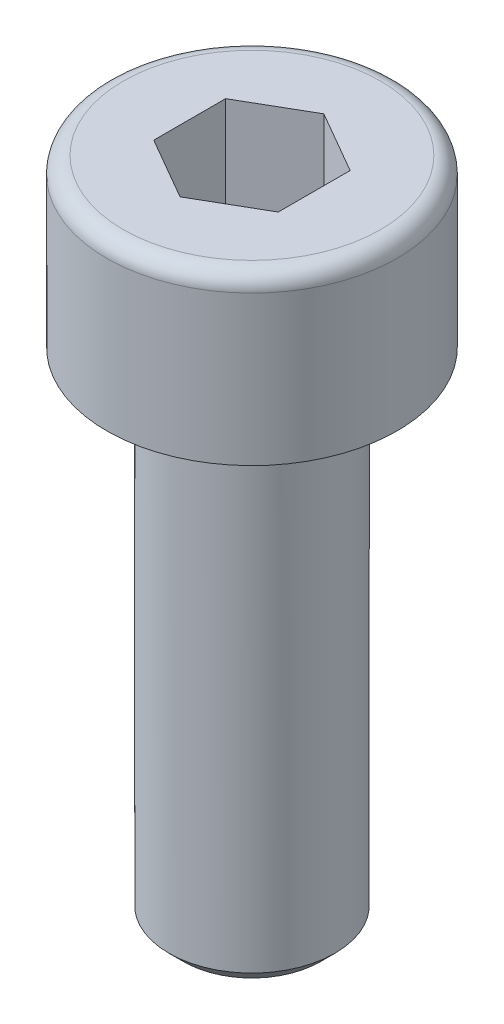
ISO-10303-21;
HEADER;
FILE_DESCRIPTION(('STEP AP214'),'2;1');
FILE_NAME('part.step','',(''),(''),'','','');
FILE_SCHEMA(('AUTOMOTIVE_DESIGN { 1 0 10303 214 1 1 1 1 }'));
ENDSEC;
DATA;
#1=APPLICATION_CONTEXT('core data for automotive mechanical design processes');
#2=APPLICATION_PROTOCOL_DEFINITION('international standard','automotive_design',2000,#1);
#3=PRODUCT_CONTEXT('',#1,'mechanical');
#4=PRODUCT('Part','Part','',(#3));
#5=PRODUCT_RELATED_PRODUCT_CATEGORY('part','',(#4));
#6=PRODUCT_DEFINITION_FORMATION('','',#4);
#7=PRODUCT_DEFINITION_CONTEXT('part definition',#1,'design');
#8=PRODUCT_DEFINITION('design','',#6,#7);
#9=PRODUCT_DEFINITION_SHAPE('','',#8);
#10=(LENGTH_UNIT() NAMED_UNIT(*) SI_UNIT(.MILLI.,.METRE.));
#11=(NAMED_UNIT(*) PLANE_ANGLE_UNIT() SI_UNIT($,.RADIAN.));
#12=(NAMED_UNIT(*) SI_UNIT($,.STERADIAN.) SOLID_ANGLE_UNIT());
#13=UNCERTAINTY_MEASURE_WITH_UNIT(LENGTH_MEASURE(1.E-05),#10,'distance_accuracy_value','');
#14=(GEOMETRIC_REPRESENTATION_CONTEXT(3) GLOBAL_UNCERTAINTY_ASSIGNED_CONTEXT((#13)) GLOBAL_UNIT_ASSIGNED_CONTEXT((#10,
#11,#12)) REPRESENTATION_CONTEXT('',''));
#15=CARTESIAN_POINT('',(0.,0.,0.));
#16=DIRECTION('',(0.,0.,1.));
#17=DIRECTION('',(1.,0.,0.));
#18=AXIS2_PLACEMENT_3D('',#15,#16,#17);
#19=CARTESIAN_POINT('',(1.99999999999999,-16.,0.));
#20=DIRECTION('',(0.,-1.,0.));
#21=DIRECTION('',(1.,0.,0.));
#22=AXIS2_PLACEMENT_3D('',#19,#20,#21);
#23=PLANE('',#22);
#24=CARTESIAN_POINT('',(0.,-16.,0.));
#25=DIRECTION('',(0.,-1.,0.));
#26=DIRECTION('',(1.,0.,0.));
#27=AXIS2_PLACEMENT_3D('',#24,#25,#26);
#28=CIRCLE('',#27,1.65);
#29=CARTESIAN_POINT('',(1.64999999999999,-16.,0.));
#30=VERTEX_POINT('',#29);
#31=EDGE_CURVE('E11',#30,#30,#28,.T.);
#32=ORIENTED_EDGE('',*,*,#31,.T.);
#33=EDGE_LOOP('',(#32));
#34=FACE_BOUND('',#33,.T.);
#35=ADVANCED_FACE('F30',(#34),#23,.T.);
#36=CARTESIAN_POINT('',(0.,65.1172922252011,0.));
#37=DIRECTION('',(0.,1.,0.));
#38=DIRECTION('',(-1.,0.,0.));
#39=AXIS2_PLACEMENT_3D('',#36,#37,#38);
#40=CYLINDRICAL_SURFACE('',#39,2.);
#41=CARTESIAN_POINT('',(0.,-15.65,0.));
#42=DIRECTION('',(0.,-1.,0.));
#43=DIRECTION('',(1.,0.,0.));
#44=AXIS2_PLACEMENT_3D('',#41,#42,#43);
#45=CIRCLE('',#44,2.);
#46=CARTESIAN_POINT('',(1.99999999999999,-15.65,0.));
#47=VERTEX_POINT('',#46);
#48=EDGE_CURVE('E37',#47,#47,#45,.F.);
#49=ORIENTED_EDGE('',*,*,#48,.T.);
#50=EDGE_LOOP('',(#49));
#51=FACE_BOUND('',#50,.T.);
#52=CARTESIAN_POINT('',(0.,-4.,0.));
#53=DIRECTION('',(0.,1.,0.));
#54=DIRECTION('',(-1.,0.,0.));
#55=AXIS2_PLACEMENT_3D('',#52,#53,#54);
#56=CIRCLE('',#55,2.);
#57=CARTESIAN_POINT('',(-2.00000000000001,-4.,0.));
#58=VERTEX_POINT('',#57);
#59=EDGE_CURVE('E145',#58,#58,#56,.T.);
#60=ORIENTED_EDGE('',*,*,#59,.F.);
#61=EDGE_LOOP('',(#60));
#62=FACE_BOUND('',#61,.T.);
#63=ADVANCED_FACE('F150',(#51,#62),#40,.T.);
#64=CARTESIAN_POINT('',(1.99999999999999,-4.,0.));
#65=DIRECTION('',(0.,1.,0.));
#66=DIRECTION('',(-1.,0.,0.));
#67=AXIS2_PLACEMENT_3D('',#64,#65,#66);
#68=PLANE('',#67);
#69=CARTESIAN_POINT('',(0.,-4.,0.));
#70=DIRECTION('',(0.,1.,0.));
#71=DIRECTION('',(-1.,0.,0.));
#72=AXIS2_PLACEMENT_3D('',#69,#70,#71);
#73=CIRCLE('',#72,3.5);
#74=CARTESIAN_POINT('',(-3.50000000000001,-4.,0.));
#75=VERTEX_POINT('',#74);
#76=EDGE_CURVE('E142',#75,#75,#73,.T.);
#77=ORIENTED_EDGE('',*,*,#76,.F.);
#78=EDGE_LOOP('',(#77));
#79=FACE_BOUND('',#78,.T.);
#80=ORIENTED_EDGE('',*,*,#59,.T.);
#81=EDGE_LOOP('',(#80));
#82=FACE_BOUND('',#81,.T.);
#83=ADVANCED_FACE('F174',(#79,#82),#68,.F.);
#84=CARTESIAN_POINT('',(0.,65.1172922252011,0.));
#85=DIRECTION('',(0.,1.,0.));
#86=DIRECTION('',(-1.,0.,0.));
#87=AXIS2_PLACEMENT_3D('',#84,#85,#86);
#88=CYLINDRICAL_SURFACE('',#87,3.5);
#89=CARTESIAN_POINT('',(0.,-0.399999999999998,0.));
#90=DIRECTION('',(0.,1.,0.));
#91=DIRECTION('',(-1.,0.,0.));
#92=AXIS2_PLACEMENT_3D('',#89,#90,#91);
#93=CIRCLE('',#92,3.5);
#94=CARTESIAN_POINT('',(-3.50000000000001,-0.399999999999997,0.));
#95=VERTEX_POINT('',#94);
#96=EDGE_CURVE('E139',#95,#95,#93,.T.);
#97=ORIENTED_EDGE('',*,*,#96,.F.);
#98=EDGE_LOOP('',(#97));
#99=FACE_BOUND('',#98,.T.);
#100=ORIENTED_EDGE('',*,*,#76,.T.);
#101=EDGE_LOOP('',(#100));
#102=FACE_BOUND('',#101,.T.);
#103=ADVANCED_FACE('F178',(#99,#102),#88,.T.);
#104=CARTESIAN_POINT('',(0.,-0.399999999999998,0.));
#105=DIRECTION('',(0.,1.,0.));
#106=DIRECTION('',(-1.,0.,0.));
#107=AXIS2_PLACEMENT_3D('',#104,#105,#106);
#108=TOROIDAL_SURFACE('',#107,3.1,0.4);
#109=CARTESIAN_POINT('',(0.,0.,0.));
#110=DIRECTION('',(0.,1.,0.));
#111=DIRECTION('',(-1.,0.,0.));
#112=AXIS2_PLACEMENT_3D('',#109,#110,#111);
#113=CIRCLE('',#112,3.1);
#114=CARTESIAN_POINT('',(-3.10000000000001,0.,0.));
#115=VERTEX_POINT('',#114);
#116=EDGE_CURVE('E136',#115,#115,#113,.T.);
#117=ORIENTED_EDGE('',*,*,#116,.F.);
#118=EDGE_LOOP('',(#117));
#119=FACE_BOUND('',#118,.T.);
#120=ORIENTED_EDGE('',*,*,#96,.T.);
#121=EDGE_LOOP('',(#120));
#122=FACE_BOUND('',#121,.T.);
#123=ADVANCED_FACE('F184',(#119,#122),#108,.T.);
#124=CARTESIAN_POINT('',(3.09999999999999,0.,0.));
#125=DIRECTION('',(0.,-1.,0.));
#126=DIRECTION('',(1.,0.,0.));
#127=AXIS2_PLACEMENT_3D('',#124,#125,#126);
#128=PLANE('',#127);
#129=DIRECTION('',(0.,0.,1.));
#130=VECTOR('',#129,1.);
#131=CARTESIAN_POINT('',(-1.5,0.,-0.866025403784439));
#132=LINE('',#131,#130);
#133=CARTESIAN_POINT('',(-1.5,0.,-0.866025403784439));
#134=VERTEX_POINT('',#133);
#135=CARTESIAN_POINT('',(-1.5,0.,0.866025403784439));
#136=VERTEX_POINT('',#135);
#137=EDGE_CURVE('E107',#134,#136,#132,.T.);
#138=ORIENTED_EDGE('',*,*,#137,.F.);
#139=DIRECTION('',(-0.866025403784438,0.,0.5));
#140=VECTOR('',#139,1.);
#141=CARTESIAN_POINT('',(0.,0.,-1.73205080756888));
#142=LINE('',#141,#140);
#143=CARTESIAN_POINT('',(0.,0.,-1.73205080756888));
#144=VERTEX_POINT('',#143);
#145=EDGE_CURVE('E44',#144,#134,#142,.T.);
#146=ORIENTED_EDGE('',*,*,#145,.F.);
#147=DIRECTION('',(0.866025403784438,0.,0.5));
#148=VECTOR('',#147,1.);
#149=CARTESIAN_POINT('',(0.,0.,-1.73205080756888));
#150=LINE('',#149,#148);
#151=CARTESIAN_POINT('',(1.5,0.,-0.866025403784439));
#152=VERTEX_POINT('',#151);
#153=EDGE_CURVE('E352',#144,#152,#150,.T.);
#154=ORIENTED_EDGE('',*,*,#153,.T.);
#155=DIRECTION('',(0.,0.,1.));
#156=VECTOR('',#155,1.);
#157=CARTESIAN_POINT('',(1.5,0.,-0.866025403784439));
#158=LINE('',#157,#156);
#159=CARTESIAN_POINT('',(1.5,0.,0.866025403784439));
#160=VERTEX_POINT('',#159);
#161=EDGE_CURVE('E349',#152,#160,#158,.T.);
#162=ORIENTED_EDGE('',*,*,#161,.T.);
#163=DIRECTION('',(-0.866025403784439,0.,0.5));
#164=VECTOR('',#163,1.);
#165=CARTESIAN_POINT('',(1.5,0.,0.866025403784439));
#166=LINE('',#165,#164);
#167=CARTESIAN_POINT('',(0.,0.,1.73205080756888));
#168=VERTEX_POINT('',#167);
#169=EDGE_CURVE('E346',#160,#168,#166,.T.);
#170=ORIENTED_EDGE('',*,*,#169,.T.);
#171=DIRECTION('',(0.866025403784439,0.,0.5));
#172=VECTOR('',#171,1.);
#173=CARTESIAN_POINT('',(-1.5,0.,0.866025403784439));
#174=LINE('',#173,#172);
#175=EDGE_CURVE('E344',#136,#168,#174,.T.);
#176=ORIENTED_EDGE('',*,*,#175,.F.);
#177=EDGE_LOOP('',(#138,#146,#154,#162,#170,#176));
#178=FACE_BOUND('',#177,.T.);
#179=ORIENTED_EDGE('',*,*,#116,.T.);
#180=EDGE_LOOP('',(#179));
#181=FACE_BOUND('',#180,.T.);
#182=ADVANCED_FACE('F188',(#178,#181),#128,.F.);
#183=CARTESIAN_POINT('',(0.,-2.88,-1.73205080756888));
#184=DIRECTION('',(-0.5,0.,-0.866025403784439));
#185=DIRECTION('',(-0.866025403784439,0.,0.5));
#186=AXIS2_PLACEMENT_3D('',#183,#184,#185);
#187=PLANE('',#186);
#188=DIRECTION('',(0.,1.,0.));
#189=VECTOR('',#188,1.);
#190=CARTESIAN_POINT('',(0.,-2.88,-1.73205080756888));
#191=LINE('',#190,#189);
#192=CARTESIAN_POINT('',(0.,-2.88,-1.73205080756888));
#193=VERTEX_POINT('',#192);
#194=EDGE_CURVE('E134',#193,#144,#191,.T.);
#195=ORIENTED_EDGE('',*,*,#194,.T.);
#196=ORIENTED_EDGE('',*,*,#145,.T.);
#197=DIRECTION('',(0.,1.,0.));
#198=VECTOR('',#197,1.);
#199=CARTESIAN_POINT('',(-1.5,-2.88,-0.866025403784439));
#200=LINE('',#199,#198);
#201=CARTESIAN_POINT('',(-1.5,-2.88,-0.866025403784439));
#202=VERTEX_POINT('',#201);
#203=EDGE_CURVE('E112',#202,#134,#200,.T.);
#204=ORIENTED_EDGE('',*,*,#203,.F.);
#205=DIRECTION('',(-0.866025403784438,0.,0.5));
#206=VECTOR('',#205,1.);
#207=CARTESIAN_POINT('',(0.,-2.88,-1.73205080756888));
#208=LINE('',#207,#206);
#209=EDGE_CURVE('E101',#193,#202,#208,.T.);
#210=ORIENTED_EDGE('',*,*,#209,.F.);
#211=EDGE_LOOP('',(#195,#196,#204,#210));
#212=FACE_BOUND('',#211,.T.);
#213=ADVANCED_FACE('F192',(#212),#187,.F.);
#214=CARTESIAN_POINT('',(0.,-2.88,-1.73205080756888));
#215=DIRECTION('',(-0.5,0.,0.866025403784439));
#216=DIRECTION('',(0.866025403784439,0.,0.5));
#217=AXIS2_PLACEMENT_3D('',#214,#215,#216);
#218=PLANE('',#217);
#219=DIRECTION('',(0.,1.,0.));
#220=VECTOR('',#219,1.);
#221=CARTESIAN_POINT('',(1.5,-2.88,-0.866025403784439));
#222=LINE('',#221,#220);
#223=CARTESIAN_POINT('',(1.5,-2.88,-0.866025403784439));
#224=VERTEX_POINT('',#223);
#225=EDGE_CURVE('E132',#224,#152,#222,.T.);
#226=ORIENTED_EDGE('',*,*,#225,.T.);
#227=ORIENTED_EDGE('',*,*,#153,.F.);
#228=ORIENTED_EDGE('',*,*,#194,.F.);
#229=DIRECTION('',(0.866025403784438,0.,0.5));
#230=VECTOR('',#229,1.);
#231=CARTESIAN_POINT('',(0.,-2.88,-1.73205080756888));
#232=LINE('',#231,#230);
#233=EDGE_CURVE('E125',#193,#224,#232,.T.);
#234=ORIENTED_EDGE('',*,*,#233,.T.);
#235=EDGE_LOOP('',(#226,#227,#228,#234));
#236=FACE_BOUND('',#235,.T.);
#237=ADVANCED_FACE('F194',(#236),#218,.T.);
#238=CARTESIAN_POINT('',(1.5,-2.88,-0.866025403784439));
#239=DIRECTION('',(-1.,0.,0.));
#240=DIRECTION('',(0.,-1.,0.));
#241=AXIS2_PLACEMENT_3D('',#238,#239,#240);
#242=PLANE('',#241);
#243=DIRECTION('',(0.,1.,0.));
#244=VECTOR('',#243,1.);
#245=CARTESIAN_POINT('',(1.5,-2.88,0.866025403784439));
#246=LINE('',#245,#244);
#247=CARTESIAN_POINT('',(1.5,-2.88,0.866025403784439));
#248=VERTEX_POINT('',#247);
#249=EDGE_CURVE('E130',#248,#160,#246,.T.);
#250=ORIENTED_EDGE('',*,*,#249,.T.);
#251=ORIENTED_EDGE('',*,*,#161,.F.);
#252=ORIENTED_EDGE('',*,*,#225,.F.);
#253=DIRECTION('',(0.,0.,1.));
#254=VECTOR('',#253,1.);
#255=CARTESIAN_POINT('',(1.5,-2.88,-0.866025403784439));
#256=LINE('',#255,#254);
#257=EDGE_CURVE('E119',#224,#248,#256,.T.);
#258=ORIENTED_EDGE('',*,*,#257,.T.);
#259=EDGE_LOOP('',(#250,#251,#252,#258));
#260=FACE_BOUND('',#259,.T.);
#261=ADVANCED_FACE('F197',(#260),#242,.T.);
#262=CARTESIAN_POINT('',(1.5,-2.88,0.866025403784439));
#263=DIRECTION('',(-0.5,0.,-0.866025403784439));
#264=DIRECTION('',(-0.866025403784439,0.,0.5));
#265=AXIS2_PLACEMENT_3D('',#262,#263,#264);
#266=PLANE('',#265);
#267=DIRECTION('',(0.,1.,0.));
#268=VECTOR('',#267,1.);
#269=CARTESIAN_POINT('',(0.,-2.88,1.73205080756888));
#270=LINE('',#269,#268);
#271=CARTESIAN_POINT('',(0.,-2.88,1.73205080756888));
#272=VERTEX_POINT('',#271);
#273=EDGE_CURVE('E111',#272,#168,#270,.T.);
#274=ORIENTED_EDGE('',*,*,#273,.T.);
#275=ORIENTED_EDGE('',*,*,#169,.F.);
#276=ORIENTED_EDGE('',*,*,#249,.F.);
#277=DIRECTION('',(-0.866025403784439,0.,0.5));
#278=VECTOR('',#277,1.);
#279=CARTESIAN_POINT('',(1.5,-2.88,0.866025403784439));
#280=LINE('',#279,#278);
#281=EDGE_CURVE('E117',#248,#272,#280,.T.);
#282=ORIENTED_EDGE('',*,*,#281,.T.);
#283=EDGE_LOOP('',(#274,#275,#276,#282));
#284=FACE_BOUND('',#283,.T.);
#285=ADVANCED_FACE('F201',(#284),#266,.T.);
#286=CARTESIAN_POINT('',(-1.5,-2.88,0.866025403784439));
#287=DIRECTION('',(-0.5,0.,0.866025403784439));
#288=DIRECTION('',(0.866025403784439,0.,0.5));
#289=AXIS2_PLACEMENT_3D('',#286,#287,#288);
#290=PLANE('',#289);
#291=DIRECTION('',(0.,1.,0.));
#292=VECTOR('',#291,1.);
#293=CARTESIAN_POINT('',(-1.5,-2.88,0.866025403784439));
#294=LINE('',#293,#292);
#295=CARTESIAN_POINT('',(-1.5,-2.88,0.866025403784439));
#296=VERTEX_POINT('',#295);
#297=EDGE_CURVE('E104',#296,#136,#294,.T.);
#298=ORIENTED_EDGE('',*,*,#297,.T.);
#299=ORIENTED_EDGE('',*,*,#175,.T.);
#300=ORIENTED_EDGE('',*,*,#273,.F.);
#301=DIRECTION('',(0.866025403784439,0.,0.5));
#302=VECTOR('',#301,1.);
#303=CARTESIAN_POINT('',(-1.5,-2.88,0.866025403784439));
#304=LINE('',#303,#302);
#305=EDGE_CURVE('E52',#296,#272,#304,.T.);
#306=ORIENTED_EDGE('',*,*,#305,.F.);
#307=EDGE_LOOP('',(#298,#299,#300,#306));
#308=FACE_BOUND('',#307,.T.);
#309=ADVANCED_FACE('F115',(#308),#290,.F.);
#310=CARTESIAN_POINT('',(-1.5,-2.88,-0.866025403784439));
#311=DIRECTION('',(-1.,0.,0.));
#312=DIRECTION('',(0.,-1.,0.));
#313=AXIS2_PLACEMENT_3D('',#310,#311,#312);
#314=PLANE('',#313);
#315=DIRECTION('',(0.,0.,1.));
#316=VECTOR('',#315,1.);
#317=CARTESIAN_POINT('',(-1.5,-2.88,-0.866025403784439));
#318=LINE('',#317,#316);
#319=EDGE_CURVE('E94',#202,#296,#318,.T.);
#320=ORIENTED_EDGE('',*,*,#319,.F.);
#321=ORIENTED_EDGE('',*,*,#203,.T.);
#322=ORIENTED_EDGE('',*,*,#137,.T.);
#323=ORIENTED_EDGE('',*,*,#297,.F.);
#324=EDGE_LOOP('',(#320,#321,#322,#323));
#325=FACE_BOUND('',#324,.T.);
#326=ADVANCED_FACE('F105',(#325),#314,.F.);
#327=CARTESIAN_POINT('',(-1.5,-2.88,-0.866025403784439));
#328=DIRECTION('',(0.104319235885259,0.977992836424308,0.180686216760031));
#329=DIRECTION('',(0.,-0.181677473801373,0.983358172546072));
#330=AXIS2_PLACEMENT_3D('',#327,#328,#329);
#331=PLANE('',#330);
#332=DIRECTION('',(-0.85161315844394,0.181677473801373,-0.491679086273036));
#333=VECTOR('',#332,1.);
#334=CARTESIAN_POINT('',(0.,-3.2,0.));
#335=LINE('',#334,#333);
#336=CARTESIAN_POINT('',(0.,-3.2,0.));
#337=VERTEX_POINT('',#336);
#338=EDGE_CURVE('E98',#337,#202,#335,.T.);
#339=ORIENTED_EDGE('',*,*,#338,.F.);
#340=DIRECTION('',(0.,0.181677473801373,-0.983358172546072));
#341=VECTOR('',#340,1.);
#342=CARTESIAN_POINT('',(0.,-3.2,0.));
#343=LINE('',#342,#341);
#344=EDGE_CURVE('E337',#337,#193,#343,.T.);
#345=ORIENTED_EDGE('',*,*,#344,.T.);
#346=ORIENTED_EDGE('',*,*,#209,.T.);
#347=EDGE_LOOP('',(#339,#345,#346));
#348=FACE_BOUND('',#347,.T.);
#349=ADVANCED_FACE('F158',(#348),#331,.T.);
#350=CARTESIAN_POINT('',(0.,-2.88,-1.73205080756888));
#351=DIRECTION('',(-0.104319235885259,0.977992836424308,0.180686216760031));
#352=DIRECTION('',(0.,-0.181677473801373,0.983358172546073));
#353=AXIS2_PLACEMENT_3D('',#350,#351,#352);
#354=PLANE('',#353);
#355=ORIENTED_EDGE('',*,*,#344,.F.);
#356=DIRECTION('',(0.85161315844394,0.181677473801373,-0.491679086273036));
#357=VECTOR('',#356,1.);
#358=CARTESIAN_POINT('',(0.,-3.2,0.));
#359=LINE('',#358,#357);
#360=EDGE_CURVE('E90',#337,#224,#359,.T.);
#361=ORIENTED_EDGE('',*,*,#360,.T.);
#362=ORIENTED_EDGE('',*,*,#233,.F.);
#363=EDGE_LOOP('',(#355,#361,#362));
#364=FACE_BOUND('',#363,.T.);
#365=ADVANCED_FACE('F166',(#364),#354,.T.);
#366=CARTESIAN_POINT('',(-1.5,-2.88,0.866025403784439));
#367=DIRECTION('',(0.208638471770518,0.977992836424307,0.));
#368=DIRECTION('',(-0.977992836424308,0.208638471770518,0.));
#369=AXIS2_PLACEMENT_3D('',#366,#367,#368);
#370=PLANE('',#369);
#371=DIRECTION('',(-0.85161315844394,0.181677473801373,0.491679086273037));
#372=VECTOR('',#371,1.);
#373=CARTESIAN_POINT('',(0.,-3.2,0.));
#374=LINE('',#373,#372);
#375=EDGE_CURVE('E84',#337,#296,#374,.T.);
#376=ORIENTED_EDGE('',*,*,#375,.F.);
#377=ORIENTED_EDGE('',*,*,#338,.T.);
#378=ORIENTED_EDGE('',*,*,#319,.T.);
#379=EDGE_LOOP('',(#376,#377,#378));
#380=FACE_BOUND('',#379,.T.);
#381=ADVANCED_FACE('F96',(#380),#370,.T.);
#382=CARTESIAN_POINT('',(1.5,-2.88,-0.866025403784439));
#383=DIRECTION('',(-0.208638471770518,0.977992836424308,0.));
#384=DIRECTION('',(-0.977992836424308,-0.208638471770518,0.));
#385=AXIS2_PLACEMENT_3D('',#382,#383,#384);
#386=PLANE('',#385);
#387=ORIENTED_EDGE('',*,*,#360,.F.);
#388=DIRECTION('',(0.85161315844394,0.181677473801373,0.491679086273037));
#389=VECTOR('',#388,1.);
#390=CARTESIAN_POINT('',(0.,-3.2,0.));
#391=LINE('',#390,#389);
#392=EDGE_CURVE('E91',#337,#248,#391,.T.);
#393=ORIENTED_EDGE('',*,*,#392,.T.);
#394=ORIENTED_EDGE('',*,*,#257,.F.);
#395=EDGE_LOOP('',(#387,#393,#394));
#396=FACE_BOUND('',#395,.T.);
#397=ADVANCED_FACE('F217',(#396),#386,.T.);
#398=CARTESIAN_POINT('',(0.,-2.88,1.73205080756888));
#399=DIRECTION('',(0.104319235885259,0.977992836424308,-0.180686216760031));
#400=DIRECTION('',(0.,0.181677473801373,0.983358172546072));
#401=AXIS2_PLACEMENT_3D('',#398,#399,#400);
#402=PLANE('',#401);
#403=DIRECTION('',(0.,0.181677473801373,0.983358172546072));
#404=VECTOR('',#403,1.);
#405=CARTESIAN_POINT('',(0.,-3.2,0.));
#406=LINE('',#405,#404);
#407=EDGE_CURVE('E87',#337,#272,#406,.T.);
#408=ORIENTED_EDGE('',*,*,#407,.F.);
#409=ORIENTED_EDGE('',*,*,#375,.T.);
#410=ORIENTED_EDGE('',*,*,#305,.T.);
#411=EDGE_LOOP('',(#408,#409,#410));
#412=FACE_BOUND('',#411,.T.);
#413=ADVANCED_FACE('F86',(#412),#402,.T.);
#414=CARTESIAN_POINT('',(1.5,-2.88,0.866025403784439));
#415=DIRECTION('',(-0.104319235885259,0.977992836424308,-0.180686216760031));
#416=DIRECTION('',(0.,0.181677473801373,0.983358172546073));
#417=AXIS2_PLACEMENT_3D('',#414,#415,#416);
#418=PLANE('',#417);
#419=ORIENTED_EDGE('',*,*,#392,.F.);
#420=ORIENTED_EDGE('',*,*,#407,.T.);
#421=ORIENTED_EDGE('',*,*,#281,.F.);
#422=EDGE_LOOP('',(#419,#420,#421));
#423=FACE_BOUND('',#422,.T.);
#424=ADVANCED_FACE('F155',(#423),#418,.T.);
#425=CARTESIAN_POINT('',(0.,-15.65,0.));
#426=DIRECTION('',(0.,1.,0.));
#427=DIRECTION('',(-1.,0.,0.));
#428=AXIS2_PLACEMENT_3D('',#425,#426,#427);
#429=CONICAL_SURFACE('',#428,2.,0.785398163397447);
#430=ORIENTED_EDGE('',*,*,#31,.F.);
#431=EDGE_LOOP('',(#430));
#432=FACE_BOUND('',#431,.T.);
#433=ORIENTED_EDGE('',*,*,#48,.F.);
#434=EDGE_LOOP('',(#433));
#435=FACE_BOUND('',#434,.T.);
#436=ADVANCED_FACE('F153',(#432,#435),#429,.T.);
#437=CLOSED_SHELL('',(#35,#63,#83,#103,#123,#182,#213,#237,#261,#285,#309,#326,#349,#365,#381,
#397,#413,#424,#436));
#438=MANIFOLD_SOLID_BREP('B2',#437);
#439=ADVANCED_BREP_SHAPE_REPRESENTATION('',(#18,#438),#14);
#440=SHAPE_DEFINITION_REPRESENTATION(#9,#439);
ENDSEC;
END-ISO-10303-21;
